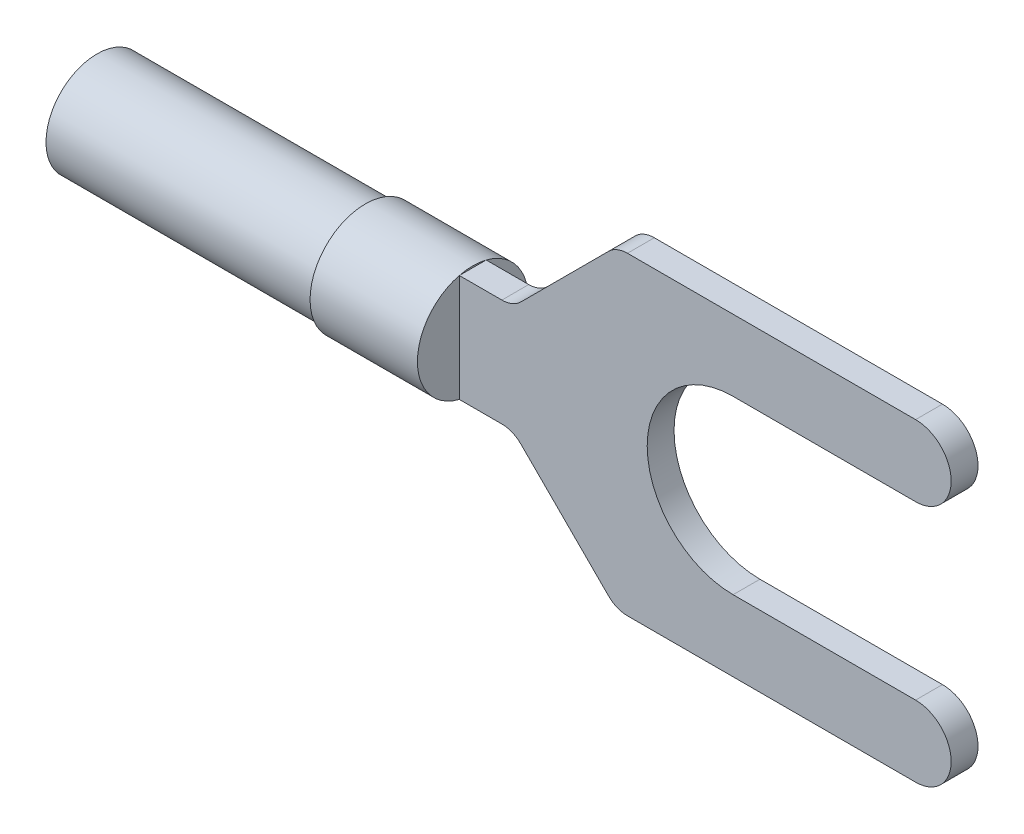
from build123d import *

# Parameters (mm, degrees)
EXTRUSION1_DEPTH = 0.5
ESQUISSE2_R      = 2.061552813
EXTRUSION2_DEPTH = 4
ESQUISSE3_R      = 1.9
EXTRUSION3_DEPTH = 10


with BuildPart() as part:
    # Esquisse1 → Extrusion1 (new, symmetric)
    with BuildSketch(Plane.XY):
        with BuildLine():
            Line((0, 3.2), (6.8, 3.2))
            ThreePointArc((6.8, 3.2), (8.125, 4.525), (6.8, 5.85))
            Line((6.8, 5.85), (-3.935786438, 5.85))
            ThreePointArc((-3.935786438, 5.85), (-4.31846987, 5.773879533), (-4.642893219, 5.557106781))
            Line((-4.642893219, 5.557106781), (-7.907106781, 2.292893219))
            ThreePointArc((-7.907106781, 2.292893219), (-8.23153013, 2.076120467), (-8.614213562, 2))
            Line((-8.614213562, 2), (-14.2, 2))
            Line((-14.2, 2), (-14.2, -2))
            Line((-14.2, -2), (-8.614213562, -2))
            ThreePointArc((-8.614213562, -2), (-8.23153013, -2.076120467), (-7.907106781, -2.292893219))
            Line((-7.907106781, -2.292893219), (-4.642893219, -5.557106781))
            ThreePointArc((-4.642893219, -5.557106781), (-4.31846987, -5.773879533), (-3.935786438, -5.85))
            Line((-3.935786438, -5.85), (6.8, -5.85))
            ThreePointArc((6.8, -5.85), (8.125, -4.525), (6.8, -3.2))
            Line((6.8, -3.2), (0, -3.2))
            ThreePointArc((0, -3.2), (-3.2, 0), (0, 3.2))
        make_face()
    extrude(amount=EXTRUSION1_DEPTH, both=True)

    # Esquisse2 → Extrusion2 (add)
    with BuildSketch(Plane.ZY.offset(14.2)):
        Circle(ESQUISSE2_R)
    extrude(amount=-EXTRUSION2_DEPTH)

    # Esquisse3 → Extrusion3 (add)
    with BuildSketch(Plane.ZY.offset(14.2)):
        with Locations(Location((0, 0, 0), (0, 0, 180))):
            Circle(ESQUISSE3_R)
    extrude(amount=EXTRUSION3_DEPTH)


solid = part.part
